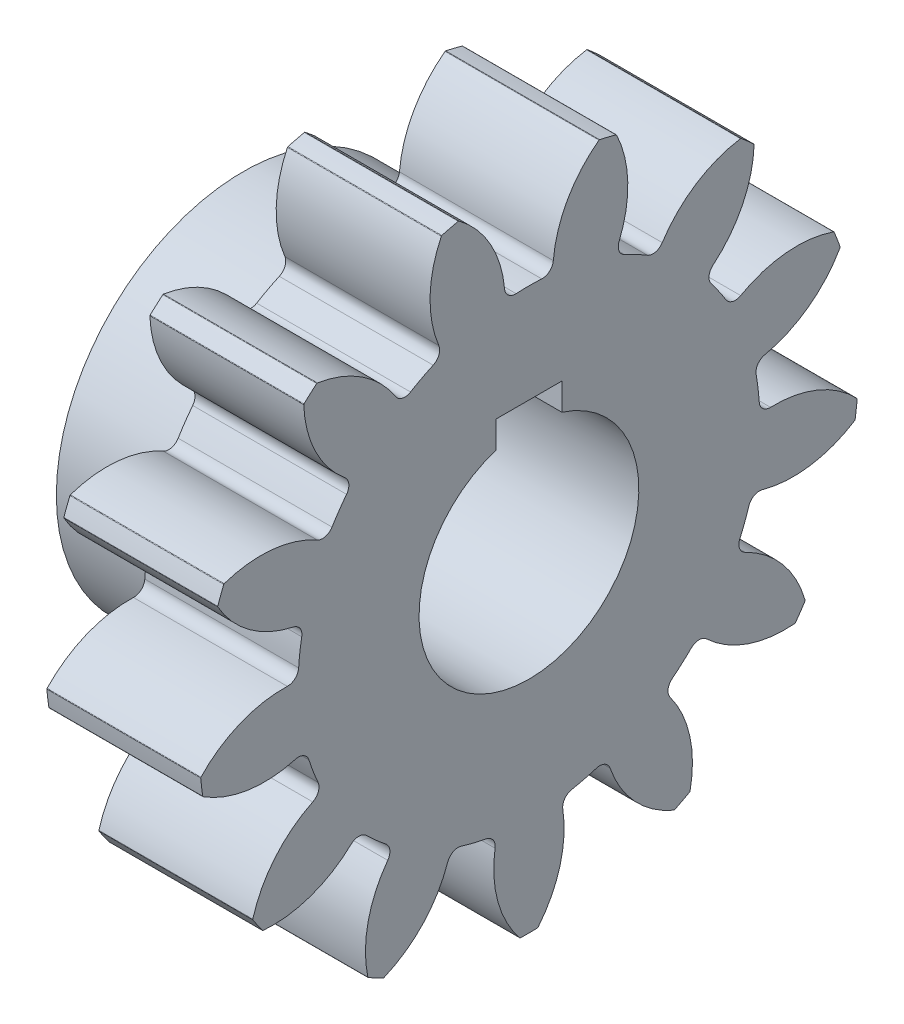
from build123d import *

# Parameters (mm, degrees)
BASPROSKE_W                = 7
BASPROSKE_H                = 15
TOOTHCUT_DEPTH             = 23.338307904
BREAKS_R                   = 0.04
ROOTFILLETS_R              = 0.501
TEETHCUTS_COUNT            = 13
TEETHCUTS_ANGLE            = 332.307692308
BREAKS_OF_TEETHCUTS_R      = 0.04
ROOTFILLETS_OF_TEETHCUTS_R = 0.501
BORSKE_R                   = 0.4
BORE_DEPTH                 = 50.0000508
CUT_EXTRUDE_1_DEPTH        = 23.292872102
SKETCH_2_R                 = 8.5
EXTRUDE_1_DEPTH            = 6


with BuildPart() as part:
    # BasProSke → Base-Revolve (revolve)
    with BuildSketch(Plane(origin=(0, 0, 0), x_dir=(1, 0, 0), z_dir=(0, 1, 0)), mode=Mode.PRIVATE) as base_revolve_sk:
        with Locations((3.5, 7.5)):
            Rectangle(BASPROSKE_W, BASPROSKE_H)
    revolve(base_revolve_sk.sketch.rotate(Axis((-10, 0, 0), (1, 0, 0)), 180), axis=Axis((-10, 0, 0), (1, 0, 0)))

    # TooCutSke → ToothCut (cut, through all)
    with BuildSketch(Plane(origin=(0, 0, 0), x_dir=(0, 0, -1), z_dir=(1, 0, 0))):
        with BuildLine():
            ThreePointArc((1.088245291, 10.442448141), (0, 10.499), (-1.088245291, 10.442448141))
            ThreePointArc((-1.088245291, 10.442448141), (-1.646045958, 12.816546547), (-3.224884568, 14.675243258))
            ThreePointArc((-3.224884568, 14.675243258), (0, 15.0254), (3.224884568, 14.675243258))
            ThreePointArc((3.224884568, 14.675243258), (1.646045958, 12.816546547), (1.088245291, 10.442448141))
        make_face()
    toothcut = extrude(amount=TOOTHCUT_DEPTH, mode=Mode.SUBTRACT)

    # Breaks
    breaks_edges = [part.edges().sort_by_distance(p)[0] for p in [
        (3.5, 14.655215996, -3.197599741),
        (3.5, 14.655215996, 3.197599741),
    ]]
    fillet(breaks_edges, radius=BREAKS_R)

    # RootFillets
    rootfillets_edges = [part.edges().sort_by_distance(p)[0] for p in [
        (3.5, 10.442448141, -1.088245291),
        (3.5, 10.442448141, 1.088245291),
    ]]
    fillet(rootfillets_edges, radius=ROOTFILLETS_R)

    # TeethCuts: ToothCut ×13 about axis
    teethcuts_axis = Axis((-10, 0, 0), (1, 0, 0))
    for i in range(1, TEETHCUTS_COUNT):
        add(toothcut.rotate(teethcuts_axis, i * TEETHCUTS_ANGLE / (TEETHCUTS_COUNT - 1)), mode=Mode.SUBTRACT)

    # Breaks of TeethCuts
    breaks_of_teethcuts_edges = [part.edges().sort_by_distance(p)[0] for p in [
        (3.5, 14.462548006, 3.979284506),
        (3.5, 11.490550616, 9.641952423),
        (3.5, 10.95668456, 10.244562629),
        (3.5, 5.693538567, 13.877450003),
        (3.5, 4.940776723, 14.162934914),
        (3.5, -1.407794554, 14.933791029),
        (3.5, -2.207003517, 14.836749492),
        (3.5, -8.186618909, 12.568980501),
        (3.5, -8.84918585, 12.111643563),
        (3.5, -13.08998753, 7.324768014),
        (3.5, -13.464126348, 6.611906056),
        (3.5, -14.99459776, 0.402539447),
        (3.5, -14.99459776, -0.402539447),
        (3.5, -13.464126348, -6.611906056),
        (3.5, -13.08998753, -7.324768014),
        (3.5, -8.84918585, -12.111643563),
        (3.5, -8.186618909, -12.568980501),
        (3.5, -2.207003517, -14.836749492),
        (3.5, -1.407794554, -14.933791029),
        (3.5, 4.940776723, -14.162934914),
        (3.5, 5.693538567, -13.877450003),
        (3.5, 10.95668456, -10.244562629),
        (3.5, 11.490550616, -9.641952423),
        (3.5, 14.462548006, -3.979284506),
    ]]
    fillet(breaks_of_teethcuts_edges, radius=BREAKS_OF_TEETHCUTS_R)

    # RootFillets of TeethCuts
    rootfillets_of_teethcuts_edges = [part.edges().sort_by_distance(p)[0] for p in [
        (3.5, 9.752061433, 3.889254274),
        (3.5, 8.740595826, 5.816440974),
        (3.5, 6.827594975, 7.975772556),
        (3.5, 5.036378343, 9.212160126),
        (3.5, 2.33900879, 10.235137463),
        (3.5, 0.178387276, 10.497484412),
        (3.5, -2.685416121, 10.149755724),
        (3.5, -4.720470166, 9.377961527),
        (3.5, -7.094644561, 7.739187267),
        (3.5, -8.537924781, 6.110060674),
        (3.5, -9.878575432, 3.555664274),
        (3.5, -10.399443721, 1.442418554),
        (3.5, -10.399443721, -1.442418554),
        (3.5, -9.878575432, -3.555664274),
        (3.5, -8.537924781, -6.110060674),
        (3.5, -7.094644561, -7.739187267),
        (3.5, -4.720470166, -9.377961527),
        (3.5, -2.685416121, -10.149755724),
        (3.5, 0.178387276, -10.497484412),
        (3.5, 2.33900879, -10.235137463),
        (3.5, 5.036378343, -9.212160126),
        (3.5, 6.827594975, -7.975772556),
        (3.5, 8.740595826, -5.816440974),
        (3.5, 9.752061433, -3.889254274),
    ]]
    fillet(rootfillets_of_teethcuts_edges, radius=ROOTFILLETS_OF_TEETHCUTS_R)

    # BorSke → Bore (cut, symmetric)
    with BuildSketch(Plane(origin=(0, 0, 0), x_dir=(0, 0, -1), z_dir=(1, 0, 0))):
        with Locations(Location((0, 0, 0), (0, 0, 180))):
            Circle(BORSKE_R)
    extrude(amount=BORE_DEPTH, both=True, mode=Mode.SUBTRACT)

    # Sketch 1 → Cut-Extrude 1 (cut, through all)
    with BuildSketch(Plane(origin=(7, 0, 0), x_dir=(0, 0, -1), z_dir=(1, 0, 0))):
        with BuildLine():
            Line((1.5, 4.769696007), (1.5, 6))
            Line((1.5, 6), (-1.5, 6))
            Line((-1.5, 6), (-1.5, 4.769696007))
            ThreePointArc((-1.5, 4.769696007), (0, -5), (1.5, 4.769696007))
        make_face()
    extrude(amount=-CUT_EXTRUDE_1_DEPTH, mode=Mode.SUBTRACT)

    # Sketch 2 → Extrude 1 (add)
    with BuildSketch(Plane.ZY):
        with Locations(Location((0, 0, 0), (0, 0, 180))):
            Circle(SKETCH_2_R)
        with BuildLine():
            Line((1.5, 6), (1.5, 4.769696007))
            ThreePointArc((1.5, 4.769696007), (0, -5), (-1.5, 4.769696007))
            Line((-1.5, 4.769696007), (-1.5, 6))
            Line((-1.5, 6), (1.5, 6))
        make_face(mode=Mode.SUBTRACT)
    extrude(amount=EXTRUDE_1_DEPTH)


solid = part.part
